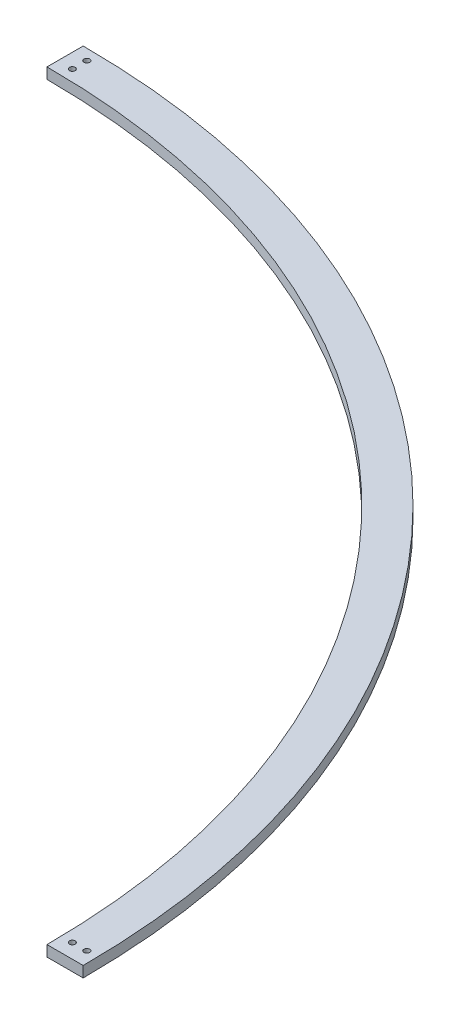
from build123d import *

# Parameters (mm, degrees)
SKETCH1_R           = 0.8
BOSS_EXTRUDE1_DEPTH = 3


with BuildPart() as part:
    # Sketch1 → Boss-Extrude1 (new body)
    with BuildSketch(Plane(origin=(0, 0, 0), x_dir=(1, 0, 0), z_dir=(0, 1, 0))):
        with BuildLine():
            Line((0, 220), (0, 210))
            ThreePointArc((0, 210), (148.492424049, 148.492424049), (210, 0))
            Line((210, 0), (220, 0))
            ThreePointArc((220, 0), (155.563491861, 155.563491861), (0, 220))
        make_face()
        with Locations(Location((217, 4, 0), (0, 0, 270))):
            Circle(SKETCH1_R, mode=Mode.SUBTRACT)
        with Locations(Location((213, 4, 0), (0, 0, 90))):
            Circle(SKETCH1_R, mode=Mode.SUBTRACT)
        with Locations(Location((4, 217, 0), (0, 0, 270))):
            Circle(SKETCH1_R, mode=Mode.SUBTRACT)
        with Locations(Location((4, 213, 0), (0, 0, 90))):
            Circle(SKETCH1_R, mode=Mode.SUBTRACT)
    extrude(amount=BOSS_EXTRUDE1_DEPTH)


solid = part.part
